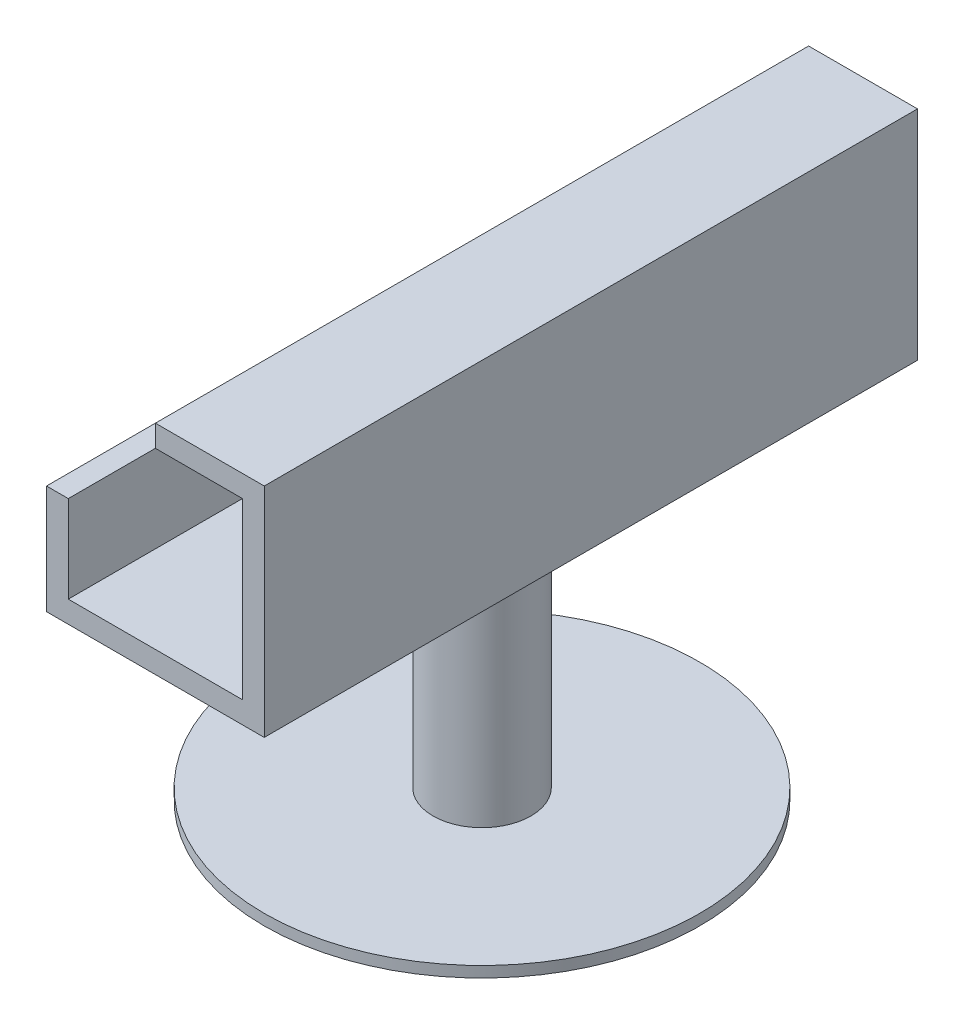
from build123d import *

# Parameters (mm, degrees)
ESQUISSE1_W             = 40
ESQUISSE1_H             = 40
ESQUISSE1_W_2           = 32
ESQUISSE1_H_2           = 32
BOSS_EXTRU_1_DEPTH      = 120
ESQUISSE2_R             = 40
BOSS_EXTRU_2_DEPTH      = 2
ESQUISSE3_R             = 9
BOSS_EXTRU_3_DEPTH      = 48
ESQUISSE4_W             = 36.933724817
ESQUISSE4_H             = 29.38316292
ENL_V_MAT_EXTRU_1_DEPTH = 145.568322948


with BuildPart() as part:
    # Esquisse1 → Boss.-Extru.1 (new body)
    with BuildSketch(Plane.XY):
        Rectangle(ESQUISSE1_W, ESQUISSE1_H)
        Rectangle(ESQUISSE1_W_2, ESQUISSE1_H_2, mode=Mode.SUBTRACT)
    extrude(amount=BOSS_EXTRU_1_DEPTH)



with BuildPart() as body_2:
    # Esquisse2 → Boss.-Extru.2 (new body)
    with BuildSketch(Plane(origin=(0, -70, 0), x_dir=(-1, 0, 0), z_dir=(0, 1, 0))):
        with Locations(Location((0, 60, 0), (0, 0, 90))):
            Circle(ESQUISSE2_R)
    extrude(amount=BOSS_EXTRU_2_DEPTH)


with BuildPart() as part_1:
    add(part.part)

    add(body_2.part)  # Boss.-Extru.3 merges body 2
    # Esquisse3 → Boss.-Extru.3 (add)
    with BuildSketch(Plane(origin=(0, -68, 0), x_dir=(1, 0, 0), z_dir=(0, 1, 0))):
        with Locations(Location((0, -60, 0), (0, 0, 270))):
            Circle(ESQUISSE3_R)
    extrude(amount=BOSS_EXTRU_3_DEPTH)

    # Esquisse4 → Enl_v. mat.-Extru.1 (cut, through all)
    with BuildSketch(Plane.XY.offset(120)):
        with Locations((-18.466862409, 14.69158146)):
            Rectangle(ESQUISSE4_W, ESQUISSE4_H)
    extrude(amount=-ENL_V_MAT_EXTRU_1_DEPTH, mode=Mode.SUBTRACT)


solid = part_1.part
